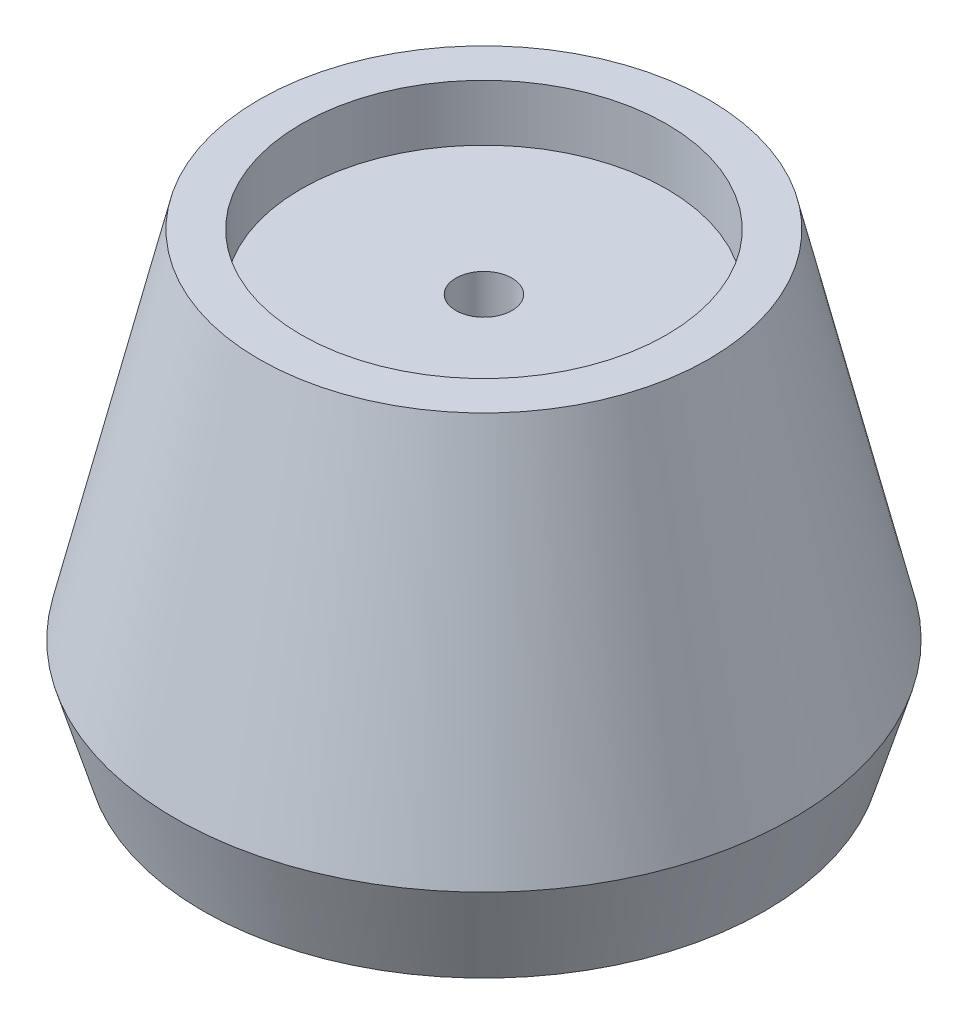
ISO-10303-21;
HEADER;
FILE_DESCRIPTION(('STEP AP214'),'2;1');
FILE_NAME('part.step','',(''),(''),'','','');
FILE_SCHEMA(('AUTOMOTIVE_DESIGN { 1 0 10303 214 1 1 1 1 }'));
ENDSEC;
DATA;
#1=APPLICATION_CONTEXT('core data for automotive mechanical design processes');
#2=APPLICATION_PROTOCOL_DEFINITION('international standard','automotive_design',2000,#1);
#3=PRODUCT_CONTEXT('',#1,'mechanical');
#4=PRODUCT('Part','Part','',(#3));
#5=PRODUCT_RELATED_PRODUCT_CATEGORY('part','',(#4));
#6=PRODUCT_DEFINITION_FORMATION('','',#4);
#7=PRODUCT_DEFINITION_CONTEXT('part definition',#1,'design');
#8=PRODUCT_DEFINITION('design','',#6,#7);
#9=PRODUCT_DEFINITION_SHAPE('','',#8);
#10=(LENGTH_UNIT() NAMED_UNIT(*) SI_UNIT(.MILLI.,.METRE.));
#11=(NAMED_UNIT(*) PLANE_ANGLE_UNIT() SI_UNIT($,.RADIAN.));
#12=(NAMED_UNIT(*) SI_UNIT($,.STERADIAN.) SOLID_ANGLE_UNIT());
#13=UNCERTAINTY_MEASURE_WITH_UNIT(LENGTH_MEASURE(1.E-05),#10,'distance_accuracy_value','');
#14=(GEOMETRIC_REPRESENTATION_CONTEXT(3) GLOBAL_UNCERTAINTY_ASSIGNED_CONTEXT((#13)) GLOBAL_UNIT_ASSIGNED_CONTEXT((#10,
#11,#12)) REPRESENTATION_CONTEXT('',''));
#15=CARTESIAN_POINT('',(0.,0.,0.));
#16=DIRECTION('',(0.,0.,1.));
#17=DIRECTION('',(1.,0.,0.));
#18=AXIS2_PLACEMENT_3D('',#15,#16,#17);
#19=CARTESIAN_POINT('',(0.,-50.8,0.));
#20=DIRECTION('',(0.,1.,0.));
#21=DIRECTION('',(0.,0.,1.));
#22=AXIS2_PLACEMENT_3D('',#19,#20,#21);
#23=CYLINDRICAL_SURFACE('',#22,6.35);
#24=CARTESIAN_POINT('',(0.,88.9,0.));
#25=DIRECTION('',(0.,1.,0.));
#26=DIRECTION('',(0.,0.,1.));
#27=AXIS2_PLACEMENT_3D('',#24,#25,#26);
#28=CIRCLE('',#27,6.35);
#29=CARTESIAN_POINT('',(0.,88.8999999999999,6.35));
#30=VERTEX_POINT('',#29);
#31=EDGE_CURVE('E55',#30,#30,#28,.T.);
#32=CARTESIAN_POINT('',(0.,6.35,0.));
#33=DIRECTION('',(0.,-1.,0.));
#34=DIRECTION('',(0.,0.,-1.));
#35=AXIS2_PLACEMENT_3D('',#32,#33,#34);
#36=CIRCLE('',#35,6.35);
#37=CARTESIAN_POINT('',(0.,6.35,6.35));
#38=VERTEX_POINT('',#37);
#39=EDGE_CURVE('E41',#38,#38,#36,.F.);
#40=CARTESIAN_POINT('',(0.,88.8999999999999,6.35));
#41=CARTESIAN_POINT('',(0.,88.0401041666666,6.35));
#42=CARTESIAN_POINT('',(0.,87.1802083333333,6.35));
#43=CARTESIAN_POINT('',(0.,85.4604166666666,6.35));
#44=CARTESIAN_POINT('',(0.,84.6005208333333,6.35));
#45=CARTESIAN_POINT('',(0.,82.8807291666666,6.35));
#46=CARTESIAN_POINT('',(0.,82.0208333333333,6.35));
#47=CARTESIAN_POINT('',(0.,80.3010416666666,6.35));
#48=CARTESIAN_POINT('',(0.,79.4411458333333,6.35));
#49=CARTESIAN_POINT('',(0.,77.7213541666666,6.35));
#50=CARTESIAN_POINT('',(0.,76.8614583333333,6.35));
#51=CARTESIAN_POINT('',(0.,75.1416666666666,6.35));
#52=CARTESIAN_POINT('',(0.,74.2817708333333,6.35));
#53=CARTESIAN_POINT('',(0.,72.5619791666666,6.35));
#54=CARTESIAN_POINT('',(0.,71.7020833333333,6.35));
#55=CARTESIAN_POINT('',(0.,69.9822916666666,6.35));
#56=CARTESIAN_POINT('',(0.,69.1223958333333,6.35));
#57=CARTESIAN_POINT('',(0.,67.4026041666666,6.35));
#58=CARTESIAN_POINT('',(0.,66.5427083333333,6.35));
#59=CARTESIAN_POINT('',(0.,64.8229166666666,6.35));
#60=CARTESIAN_POINT('',(0.,63.9630208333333,6.35));
#61=CARTESIAN_POINT('',(0.,62.2432291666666,6.35));
#62=CARTESIAN_POINT('',(0.,61.3833333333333,6.35));
#63=CARTESIAN_POINT('',(0.,59.6635416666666,6.35));
#64=CARTESIAN_POINT('',(0.,58.8036458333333,6.35));
#65=CARTESIAN_POINT('',(0.,57.0838541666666,6.35));
#66=CARTESIAN_POINT('',(0.,56.2239583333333,6.35));
#67=CARTESIAN_POINT('',(0.,54.5041666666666,6.35));
#68=CARTESIAN_POINT('',(0.,53.6442708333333,6.35));
#69=CARTESIAN_POINT('',(0.,51.9244791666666,6.35));
#70=CARTESIAN_POINT('',(0.,51.0645833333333,6.35));
#71=CARTESIAN_POINT('',(0.,49.3447916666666,6.35));
#72=CARTESIAN_POINT('',(0.,48.4848958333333,6.35));
#73=CARTESIAN_POINT('',(0.,46.7651041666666,6.35));
#74=CARTESIAN_POINT('',(0.,45.9052083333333,6.35));
#75=CARTESIAN_POINT('',(0.,44.1854166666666,6.35));
#76=CARTESIAN_POINT('',(0.,43.3255208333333,6.35));
#77=CARTESIAN_POINT('',(0.,41.6057291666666,6.35));
#78=CARTESIAN_POINT('',(0.,40.7458333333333,6.35));
#79=CARTESIAN_POINT('',(0.,39.0260416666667,6.35));
#80=CARTESIAN_POINT('',(0.,38.1661458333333,6.35));
#81=CARTESIAN_POINT('',(0.,36.4463541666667,6.35));
#82=CARTESIAN_POINT('',(0.,35.5864583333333,6.35));
#83=CARTESIAN_POINT('',(0.,33.8666666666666,6.35));
#84=CARTESIAN_POINT('',(0.,33.0067708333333,6.35));
#85=CARTESIAN_POINT('',(0.,31.2869791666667,6.35));
#86=CARTESIAN_POINT('',(0.,30.4270833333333,6.35));
#87=CARTESIAN_POINT('',(0.,28.7072916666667,6.35));
#88=CARTESIAN_POINT('',(0.,27.8473958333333,6.35));
#89=CARTESIAN_POINT('',(0.,26.1276041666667,6.35));
#90=CARTESIAN_POINT('',(0.,25.2677083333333,6.35));
#91=CARTESIAN_POINT('',(0.,23.5479166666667,6.35));
#92=CARTESIAN_POINT('',(0.,22.6880208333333,6.35));
#93=CARTESIAN_POINT('',(0.,20.9682291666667,6.35));
#94=CARTESIAN_POINT('',(0.,20.1083333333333,6.35));
#95=CARTESIAN_POINT('',(0.,18.3885416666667,6.35));
#96=CARTESIAN_POINT('',(0.,17.5286458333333,6.35));
#97=CARTESIAN_POINT('',(0.,15.8088541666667,6.35));
#98=CARTESIAN_POINT('',(0.,14.9489583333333,6.35));
#99=CARTESIAN_POINT('',(0.,13.2291666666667,6.35));
#100=CARTESIAN_POINT('',(0.,12.3692708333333,6.35));
#101=CARTESIAN_POINT('',(0.,10.6494791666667,6.35));
#102=CARTESIAN_POINT('',(0.,9.78958333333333,6.35));
#103=CARTESIAN_POINT('',(0.,8.06979166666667,6.35));
#104=CARTESIAN_POINT('',(0.,7.20989583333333,6.35));
#105=CARTESIAN_POINT('',(0.,6.35,6.35));
#106=B_SPLINE_CURVE_WITH_KNOTS('',3,(#40,#41,#42,#43,#44,#45,#46,#47,#48,#49,#50,#51,#52,#53,
#54,#55,#56,#57,#58,#59,#60,#61,#62,#63,#64,#65,#66,#67,#68,#69,#70,#71,#72,#73,#74,#75,#76,#77,
#78,#79,#80,#81,#82,#83,#84,#85,#86,#87,#88,#89,#90,#91,#92,#93,#94,#95,#96,#97,#98,#99,#100,
#101,#102,#103,#104,#105),.UNSPECIFIED.,.F.,.F.,(4,2,2,2,2,2,2,2,2,2,2,2,2,2,2,2,2,2,2,2,2,2,2,
2,2,2,2,2,2,2,2,2,4),(0.,2.57968750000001,5.15937499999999,7.7390625,10.31875,12.8984375,
15.478125,18.0578125,20.6375,23.2171875,25.796875,28.3765625,30.95625,33.5359375,36.115625,
38.6953125,41.275,43.8546875,46.434375,49.0140625,51.59375,54.1734375,56.753125,59.3328125,
61.9125,64.4921875,67.071875,69.6515625,72.23125,74.8109375,77.390625,79.9703125,82.55),.UNSPECIFIED.);
#107=EDGE_CURVE('BSEAM37',#30,#38,#106,.T.);
#108=ORIENTED_EDGE('',*,*,#31,.T.);
#109=ORIENTED_EDGE('',*,*,#39,.F.);
#110=ORIENTED_EDGE('',*,*,#107,.T.);
#111=ORIENTED_EDGE('',*,*,#107,.F.);
#112=EDGE_LOOP('',(#108,#110,#109,#111));
#113=FACE_BOUND('',#112,.T.);
#114=ADVANCED_FACE('F37',(#113),#23,.F.);
#115=CARTESIAN_POINT('',(63.5,0.,0.));
#116=DIRECTION('',(0.,-1.,0.));
#117=DIRECTION('',(0.,0.,-1.));
#118=AXIS2_PLACEMENT_3D('',#115,#116,#117);
#119=PLANE('',#118);
#120=CARTESIAN_POINT('',(0.,0.,0.));
#121=DIRECTION('',(0.,-1.,0.));
#122=DIRECTION('',(0.,0.,-1.));
#123=AXIS2_PLACEMENT_3D('',#120,#121,#122);
#124=CIRCLE('',#123,57.15);
#125=CARTESIAN_POINT('',(0.,0.,-57.15));
#126=VERTEX_POINT('',#125);
#127=EDGE_CURVE('E72',#126,#126,#124,.T.);
#128=ORIENTED_EDGE('',*,*,#127,.F.);
#129=EDGE_LOOP('',(#128));
#130=FACE_BOUND('',#129,.T.);
#131=CARTESIAN_POINT('',(0.,0.,0.));
#132=DIRECTION('',(0.,-1.,0.));
#133=DIRECTION('',(0.,0.,-1.));
#134=AXIS2_PLACEMENT_3D('',#131,#132,#133);
#135=CIRCLE('',#134,63.5);
#136=CARTESIAN_POINT('',(0.,0.,-63.5));
#137=VERTEX_POINT('',#136);
#138=EDGE_CURVE('E52',#137,#137,#135,.T.);
#139=ORIENTED_EDGE('',*,*,#138,.T.);
#140=EDGE_LOOP('',(#139));
#141=FACE_BOUND('',#140,.T.);
#142=ADVANCED_FACE('F39',(#130,#141),#119,.T.);
#143=CARTESIAN_POINT('',(0.,101.6,0.));
#144=DIRECTION('',(0.,1.,0.));
#145=DIRECTION('',(0.,0.,1.));
#146=AXIS2_PLACEMENT_3D('',#143,#144,#145);
#147=PLANE('',#146);
#148=CARTESIAN_POINT('',(0.,101.6,0.));
#149=DIRECTION('',(0.,1.,0.));
#150=DIRECTION('',(0.,0.,1.));
#151=AXIS2_PLACEMENT_3D('',#148,#149,#150);
#152=CIRCLE('',#151,41.275);
#153=CARTESIAN_POINT('',(0.,101.6,41.275));
#154=VERTEX_POINT('',#153);
#155=EDGE_CURVE('E58',#154,#154,#152,.T.);
#156=ORIENTED_EDGE('',*,*,#155,.F.);
#157=EDGE_LOOP('',(#156));
#158=FACE_BOUND('',#157,.T.);
#159=CARTESIAN_POINT('',(0.,101.6,0.));
#160=DIRECTION('',(0.,-1.,0.));
#161=DIRECTION('',(0.,0.,-1.));
#162=AXIS2_PLACEMENT_3D('',#159,#160,#161);
#163=CIRCLE('',#162,50.8);
#164=CARTESIAN_POINT('',(0.,101.6,-50.8));
#165=VERTEX_POINT('',#164);
#166=EDGE_CURVE('E10',#165,#165,#163,.T.);
#167=ORIENTED_EDGE('',*,*,#166,.F.);
#168=EDGE_LOOP('',(#167));
#169=FACE_BOUND('',#168,.T.);
#170=ADVANCED_FACE('F100',(#158,#169),#147,.T.);
#171=CARTESIAN_POINT('',(0.,21.3021820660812,0.));
#172=DIRECTION('',(0.,-1.,0.));
#173=DIRECTION('',(0.,0.,-1.));
#174=AXIS2_PLACEMENT_3D('',#171,#172,#173);
#175=CONICAL_SURFACE('',#174,69.85,0.232935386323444);
#176=ORIENTED_EDGE('',*,*,#166,.T.);
#177=EDGE_LOOP('',(#176));
#178=FACE_BOUND('',#177,.T.);
#179=CARTESIAN_POINT('',(0.,21.3021820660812,0.));
#180=DIRECTION('',(0.,-1.,0.));
#181=DIRECTION('',(0.,0.,-1.));
#182=AXIS2_PLACEMENT_3D('',#179,#180,#181);
#183=CIRCLE('',#182,69.85);
#184=CARTESIAN_POINT('',(0.,21.3021820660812,-69.85));
#185=VERTEX_POINT('',#184);
#186=EDGE_CURVE('E46',#185,#185,#183,.T.);
#187=ORIENTED_EDGE('',*,*,#186,.F.);
#188=EDGE_LOOP('',(#187));
#189=FACE_BOUND('',#188,.T.);
#190=ADVANCED_FACE('F90',(#178,#189),#175,.T.);
#191=CARTESIAN_POINT('',(0.,0.,0.));
#192=DIRECTION('',(0.,1.,0.));
#193=DIRECTION('',(0.,0.,1.));
#194=AXIS2_PLACEMENT_3D('',#191,#192,#193);
#195=CONICAL_SURFACE('',#194,63.5,0.289704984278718);
#196=ORIENTED_EDGE('',*,*,#186,.T.);
#197=EDGE_LOOP('',(#196));
#198=FACE_BOUND('',#197,.T.);
#199=ORIENTED_EDGE('',*,*,#138,.F.);
#200=EDGE_LOOP('',(#199));
#201=FACE_BOUND('',#200,.T.);
#202=ADVANCED_FACE('F87',(#198,#201),#195,.T.);
#203=CARTESIAN_POINT('',(0.,88.9,0.));
#204=DIRECTION('',(0.,1.,0.));
#205=DIRECTION('',(0.,0.,1.));
#206=AXIS2_PLACEMENT_3D('',#203,#204,#205);
#207=CYLINDRICAL_SURFACE('',#206,41.275);
#208=CARTESIAN_POINT('',(0.,88.9,0.));
#209=DIRECTION('',(0.,1.,0.));
#210=DIRECTION('',(0.,0.,1.));
#211=AXIS2_PLACEMENT_3D('',#208,#209,#210);
#212=CIRCLE('',#211,41.275);
#213=CARTESIAN_POINT('',(0.,88.9,41.275));
#214=VERTEX_POINT('',#213);
#215=EDGE_CURVE('E64',#214,#214,#212,.T.);
#216=ORIENTED_EDGE('',*,*,#215,.F.);
#217=EDGE_LOOP('',(#216));
#218=FACE_BOUND('',#217,.T.);
#219=ORIENTED_EDGE('',*,*,#155,.T.);
#220=EDGE_LOOP('',(#219));
#221=FACE_BOUND('',#220,.T.);
#222=ADVANCED_FACE('F89',(#218,#221),#207,.F.);
#223=CARTESIAN_POINT('',(0.,88.9,0.));
#224=DIRECTION('',(0.,1.,0.));
#225=DIRECTION('',(0.,0.,1.));
#226=AXIS2_PLACEMENT_3D('',#223,#224,#225);
#227=PLANE('',#226);
#228=ORIENTED_EDGE('',*,*,#31,.F.);
#229=EDGE_LOOP('',(#228));
#230=FACE_BOUND('',#229,.T.);
#231=ORIENTED_EDGE('',*,*,#215,.T.);
#232=EDGE_LOOP('',(#231));
#233=FACE_BOUND('',#232,.T.);
#234=ADVANCED_FACE('F97',(#230,#233),#227,.T.);
#235=CARTESIAN_POINT('',(0.,6.35,0.));
#236=DIRECTION('',(0.,-1.,0.));
#237=DIRECTION('',(0.,0.,-1.));
#238=AXIS2_PLACEMENT_3D('',#235,#236,#237);
#239=PLANE('',#238);
#240=CARTESIAN_POINT('',(0.,6.35,0.));
#241=DIRECTION('',(0.,-1.,0.));
#242=DIRECTION('',(0.,0.,-1.));
#243=AXIS2_PLACEMENT_3D('',#240,#241,#242);
#244=CIRCLE('',#243,57.15);
#245=CARTESIAN_POINT('',(0.,6.35,-57.15));
#246=VERTEX_POINT('',#245);
#247=EDGE_CURVE('E67',#246,#246,#244,.T.);
#248=ORIENTED_EDGE('',*,*,#247,.T.);
#249=EDGE_LOOP('',(#248));
#250=FACE_BOUND('',#249,.T.);
#251=ORIENTED_EDGE('',*,*,#39,.T.);
#252=EDGE_LOOP('',(#251));
#253=FACE_BOUND('',#252,.T.);
#254=ADVANCED_FACE('F114',(#250,#253),#239,.T.);
#255=CARTESIAN_POINT('',(0.,6.35,0.));
#256=DIRECTION('',(0.,-1.,0.));
#257=DIRECTION('',(0.,0.,-1.));
#258=AXIS2_PLACEMENT_3D('',#255,#256,#257);
#259=CYLINDRICAL_SURFACE('',#258,57.15);
#260=ORIENTED_EDGE('',*,*,#247,.F.);
#261=EDGE_LOOP('',(#260));
#262=FACE_BOUND('',#261,.T.);
#263=ORIENTED_EDGE('',*,*,#127,.T.);
#264=EDGE_LOOP('',(#263));
#265=FACE_BOUND('',#264,.T.);
#266=ADVANCED_FACE('F111',(#262,#265),#259,.F.);
#267=CLOSED_SHELL('',(#114,#142,#170,#190,#202,#222,#234,#254,#266));
#268=MANIFOLD_SOLID_BREP('B2',#267);
#269=ADVANCED_BREP_SHAPE_REPRESENTATION('',(#18,#268),#14);
#270=SHAPE_DEFINITION_REPRESENTATION(#9,#269);
ENDSEC;
END-ISO-10303-21;
